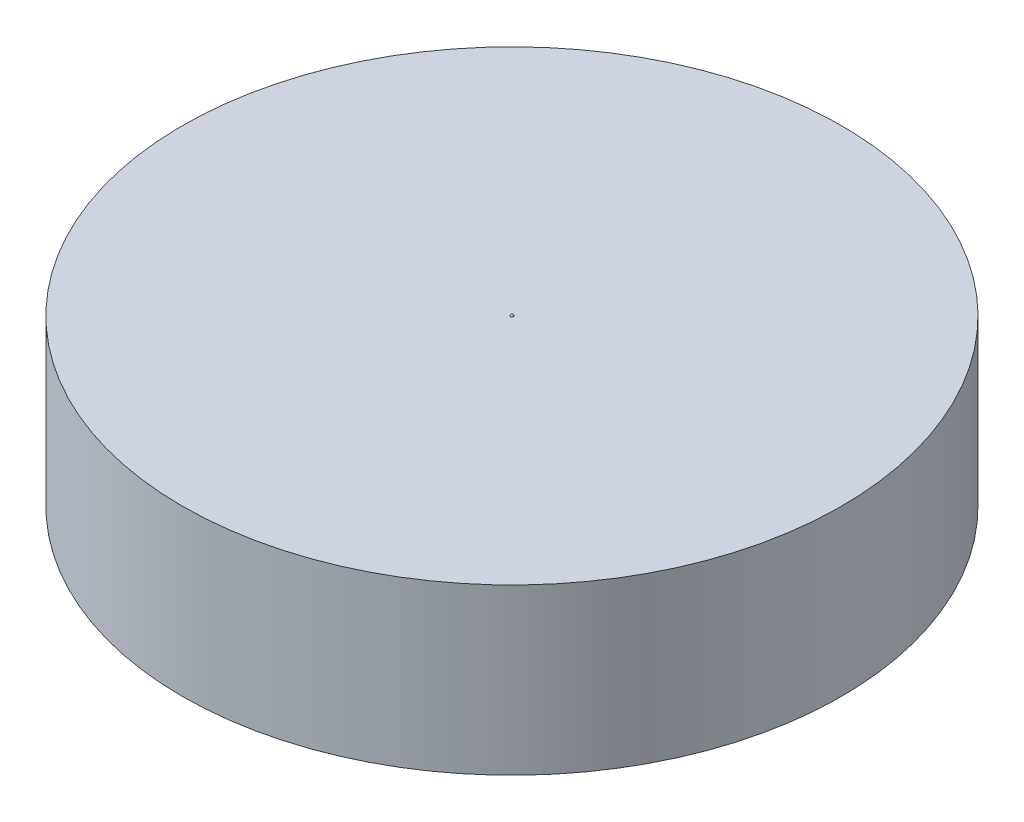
ISO-10303-21;
HEADER;
FILE_DESCRIPTION(('STEP AP214'),'2;1');
FILE_NAME('part.step','',(''),(''),'','','');
FILE_SCHEMA(('AUTOMOTIVE_DESIGN { 1 0 10303 214 1 1 1 1 }'));
ENDSEC;
DATA;
#1=APPLICATION_CONTEXT('core data for automotive mechanical design processes');
#2=APPLICATION_PROTOCOL_DEFINITION('international standard','automotive_design',2000,#1);
#3=PRODUCT_CONTEXT('',#1,'mechanical');
#4=PRODUCT('Part','Part','',(#3));
#5=PRODUCT_RELATED_PRODUCT_CATEGORY('part','',(#4));
#6=PRODUCT_DEFINITION_FORMATION('','',#4);
#7=PRODUCT_DEFINITION_CONTEXT('part definition',#1,'design');
#8=PRODUCT_DEFINITION('design','',#6,#7);
#9=PRODUCT_DEFINITION_SHAPE('','',#8);
#10=(LENGTH_UNIT() NAMED_UNIT(*) SI_UNIT(.MILLI.,.METRE.));
#11=(NAMED_UNIT(*) PLANE_ANGLE_UNIT() SI_UNIT($,.RADIAN.));
#12=(NAMED_UNIT(*) SI_UNIT($,.STERADIAN.) SOLID_ANGLE_UNIT());
#13=UNCERTAINTY_MEASURE_WITH_UNIT(LENGTH_MEASURE(1.E-05),#10,'distance_accuracy_value','');
#14=(GEOMETRIC_REPRESENTATION_CONTEXT(3) GLOBAL_UNCERTAINTY_ASSIGNED_CONTEXT((#13)) GLOBAL_UNIT_ASSIGNED_CONTEXT((#10,
#11,#12)) REPRESENTATION_CONTEXT('',''));
#15=CARTESIAN_POINT('',(0.,0.,0.));
#16=DIRECTION('',(0.,0.,1.));
#17=DIRECTION('',(1.,0.,0.));
#18=AXIS2_PLACEMENT_3D('',#15,#16,#17);
#19=CARTESIAN_POINT('',(0.,-3.,0.));
#20=DIRECTION('',(0.,1.,0.));
#21=DIRECTION('',(0.,0.,1.));
#22=AXIS2_PLACEMENT_3D('',#19,#20,#21);
#23=CYLINDRICAL_SURFACE('',#22,6.);
#24=CARTESIAN_POINT('',(0.,-3.,0.));
#25=DIRECTION('',(0.,1.,0.));
#26=DIRECTION('',(0.,0.,1.));
#27=AXIS2_PLACEMENT_3D('',#24,#25,#26);
#28=CIRCLE('',#27,6.);
#29=CARTESIAN_POINT('',(0.,-3.,6.));
#30=VERTEX_POINT('',#29);
#31=EDGE_CURVE('E37',#30,#30,#28,.T.);
#32=ORIENTED_EDGE('',*,*,#31,.T.);
#33=EDGE_LOOP('',(#32));
#34=FACE_BOUND('',#33,.T.);
#35=CARTESIAN_POINT('',(0.,0.,0.));
#36=DIRECTION('',(0.,1.,0.));
#37=DIRECTION('',(0.,0.,1.));
#38=AXIS2_PLACEMENT_3D('',#35,#36,#37);
#39=CIRCLE('',#38,6.);
#40=CARTESIAN_POINT('',(0.,0.,6.));
#41=VERTEX_POINT('',#40);
#42=EDGE_CURVE('E41',#41,#41,#39,.T.);
#43=ORIENTED_EDGE('',*,*,#42,.F.);
#44=EDGE_LOOP('',(#43));
#45=FACE_BOUND('',#44,.T.);
#46=ADVANCED_FACE('F31',(#34,#45),#23,.T.);
#47=CARTESIAN_POINT('',(0.,-3.,0.));
#48=DIRECTION('',(0.,1.,0.));
#49=DIRECTION('',(0.,0.,1.));
#50=AXIS2_PLACEMENT_3D('',#47,#48,#49);
#51=PLANE('',#50);
#52=ORIENTED_EDGE('',*,*,#31,.F.);
#53=EDGE_LOOP('',(#52));
#54=FACE_BOUND('',#53,.T.);
#55=ADVANCED_FACE('F51',(#54),#51,.F.);
#56=CARTESIAN_POINT('',(0.,0.,0.));
#57=DIRECTION('',(0.,1.,0.));
#58=DIRECTION('',(0.,0.,1.));
#59=AXIS2_PLACEMENT_3D('',#56,#57,#58);
#60=PLANE('',#59);
#61=CARTESIAN_POINT('',(0.,0.,0.));
#62=DIRECTION('',(0.,1.,0.));
#63=DIRECTION('',(0.,0.,1.));
#64=AXIS2_PLACEMENT_3D('',#61,#62,#63);
#65=CIRCLE('',#64,0.025);
#66=CARTESIAN_POINT('',(0.,0.,0.025));
#67=VERTEX_POINT('',#66);
#68=EDGE_CURVE('E10',#67,#67,#65,.T.);
#69=ORIENTED_EDGE('',*,*,#68,.F.);
#70=EDGE_LOOP('',(#69));
#71=FACE_BOUND('',#70,.T.);
#72=ORIENTED_EDGE('',*,*,#42,.T.);
#73=EDGE_LOOP('',(#72));
#74=FACE_BOUND('',#73,.T.);
#75=ADVANCED_FACE('F48',(#71,#74),#60,.T.);
#76=CARTESIAN_POINT('',(0.,0.,0.));
#77=DIRECTION('',(0.,-1.,0.));
#78=DIRECTION('',(1.,0.,0.));
#79=AXIS2_PLACEMENT_3D('',#76,#77,#78);
#80=SPHERICAL_SURFACE('',#79,0.025);
#81=ORIENTED_EDGE('',*,*,#68,.T.);
#82=EDGE_LOOP('',(#81));
#83=FACE_BOUND('',#82,.T.);
#84=ADVANCED_FACE('F60',(#83),#80,.T.);
#85=CLOSED_SHELL('',(#46,#55,#75,#84));
#86=MANIFOLD_SOLID_BREP('B2',#85);
#87=ADVANCED_BREP_SHAPE_REPRESENTATION('',(#18,#86),#14);
#88=SHAPE_DEFINITION_REPRESENTATION(#9,#87);
ENDSEC;
END-ISO-10303-21;
